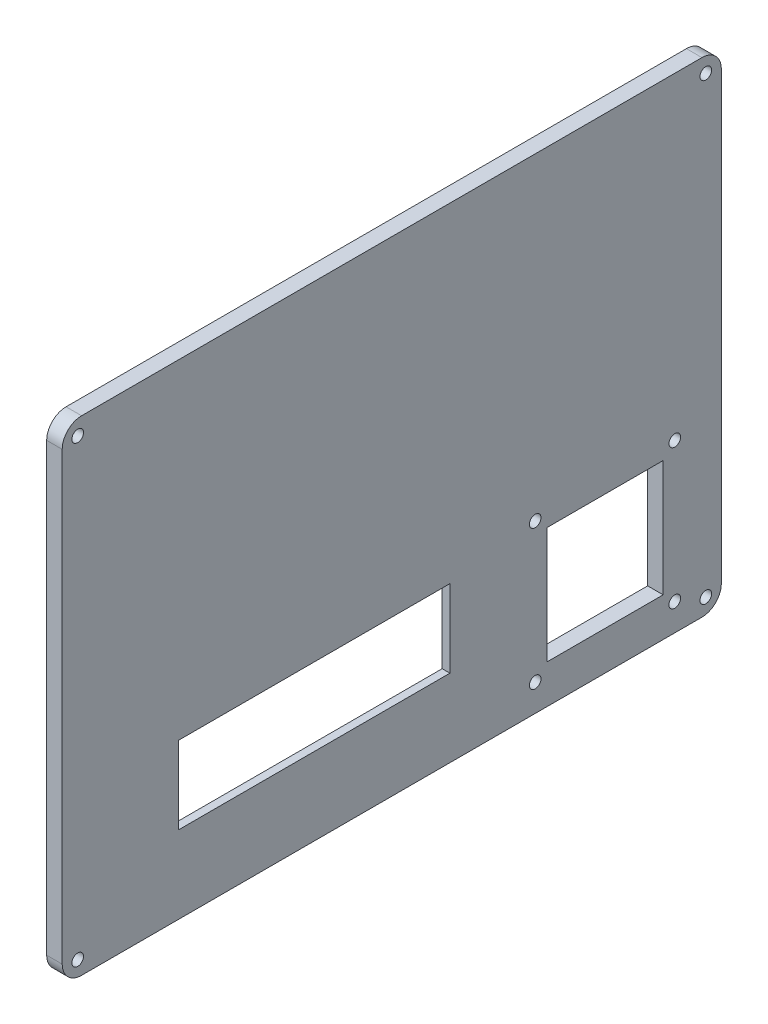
ISO-10303-21;
HEADER;
FILE_DESCRIPTION(('STEP AP214'),'2;1');
FILE_NAME('part.step','',(''),(''),'','','');
FILE_SCHEMA(('AUTOMOTIVE_DESIGN { 1 0 10303 214 1 1 1 1 }'));
ENDSEC;
DATA;
#1=APPLICATION_CONTEXT('core data for automotive mechanical design processes');
#2=APPLICATION_PROTOCOL_DEFINITION('international standard','automotive_design',2000,#1);
#3=PRODUCT_CONTEXT('',#1,'mechanical');
#4=PRODUCT('Part','Part','',(#3));
#5=PRODUCT_RELATED_PRODUCT_CATEGORY('part','',(#4));
#6=PRODUCT_DEFINITION_FORMATION('','',#4);
#7=PRODUCT_DEFINITION_CONTEXT('part definition',#1,'design');
#8=PRODUCT_DEFINITION('design','',#6,#7);
#9=PRODUCT_DEFINITION_SHAPE('','',#8);
#10=(LENGTH_UNIT() NAMED_UNIT(*) SI_UNIT(.MILLI.,.METRE.));
#11=(NAMED_UNIT(*) PLANE_ANGLE_UNIT() SI_UNIT($,.RADIAN.));
#12=(NAMED_UNIT(*) SI_UNIT($,.STERADIAN.) SOLID_ANGLE_UNIT());
#13=UNCERTAINTY_MEASURE_WITH_UNIT(LENGTH_MEASURE(1.E-05),#10,'distance_accuracy_value','');
#14=(GEOMETRIC_REPRESENTATION_CONTEXT(3) GLOBAL_UNCERTAINTY_ASSIGNED_CONTEXT((#13)) GLOBAL_UNIT_ASSIGNED_CONTEXT((#10,
#11,#12)) REPRESENTATION_CONTEXT('',''));
#15=CARTESIAN_POINT('',(0.,0.,0.));
#16=DIRECTION('',(0.,0.,1.));
#17=DIRECTION('',(1.,0.,0.));
#18=AXIS2_PLACEMENT_3D('',#15,#16,#17);
#19=CARTESIAN_POINT('',(4.,-42.5,-15.));
#20=DIRECTION('',(0.,0.,1.));
#21=DIRECTION('',(1.,0.,0.));
#22=AXIS2_PLACEMENT_3D('',#19,#20,#21);
#23=PLANE('',#22);
#24=DIRECTION('',(-1.,0.,0.));
#25=VECTOR('',#24,1.);
#26=CARTESIAN_POINT('',(4.,-22.5,-15.));
#27=LINE('',#26,#25);
#28=CARTESIAN_POINT('',(4.,-22.5,-15.));
#29=VERTEX_POINT('',#28);
#30=CARTESIAN_POINT('',(2.,-22.5,-15.));
#31=VERTEX_POINT('',#30);
#32=EDGE_CURVE('E305',#29,#31,#27,.T.);
#33=ORIENTED_EDGE('',*,*,#32,.T.);
#34=DIRECTION('',(0.,-1.,0.));
#35=VECTOR('',#34,1.);
#36=CARTESIAN_POINT('',(2.,-42.5,-15.));
#37=LINE('',#36,#35);
#38=CARTESIAN_POINT('',(2.,-42.5,-15.));
#39=VERTEX_POINT('',#38);
#40=EDGE_CURVE('E240',#31,#39,#37,.T.);
#41=ORIENTED_EDGE('',*,*,#40,.T.);
#42=DIRECTION('',(-1.,0.,0.));
#43=VECTOR('',#42,1.);
#44=CARTESIAN_POINT('',(4.,-42.5,-15.));
#45=LINE('',#44,#43);
#46=CARTESIAN_POINT('',(4.,-42.5,-15.));
#47=VERTEX_POINT('',#46);
#48=EDGE_CURVE('E293',#47,#39,#45,.T.);
#49=ORIENTED_EDGE('',*,*,#48,.F.);
#50=DIRECTION('',(0.,1.,0.));
#51=VECTOR('',#50,1.);
#52=CARTESIAN_POINT('',(4.,-42.5,-15.));
#53=LINE('',#52,#51);
#54=EDGE_CURVE('E279',#47,#29,#53,.T.);
#55=ORIENTED_EDGE('',*,*,#54,.T.);
#56=EDGE_LOOP('',(#33,#41,#49,#55));
#57=FACE_BOUND('',#56,.T.);
#58=ADVANCED_FACE('F47',(#57),#23,.T.);
#59=CARTESIAN_POINT('',(4.,-22.5,-15.));
#60=DIRECTION('',(0.,-1.,0.));
#61=DIRECTION('',(0.,0.,-1.));
#62=AXIS2_PLACEMENT_3D('',#59,#60,#61);
#63=PLANE('',#62);
#64=DIRECTION('',(-1.,0.,0.));
#65=VECTOR('',#64,1.);
#66=CARTESIAN_POINT('',(4.,-22.5,55.));
#67=LINE('',#66,#65);
#68=CARTESIAN_POINT('',(4.,-22.5,55.));
#69=VERTEX_POINT('',#68);
#70=CARTESIAN_POINT('',(2.,-22.5,55.));
#71=VERTEX_POINT('',#70);
#72=EDGE_CURVE('E301',#69,#71,#67,.T.);
#73=ORIENTED_EDGE('',*,*,#72,.T.);
#74=DIRECTION('',(0.,0.,-1.));
#75=VECTOR('',#74,1.);
#76=CARTESIAN_POINT('',(2.,-22.5,-15.));
#77=LINE('',#76,#75);
#78=EDGE_CURVE('E236',#71,#31,#77,.T.);
#79=ORIENTED_EDGE('',*,*,#78,.T.);
#80=ORIENTED_EDGE('',*,*,#32,.F.);
#81=DIRECTION('',(0.,0.,1.));
#82=VECTOR('',#81,1.);
#83=CARTESIAN_POINT('',(4.,-22.5,-15.));
#84=LINE('',#83,#82);
#85=EDGE_CURVE('E282',#29,#69,#84,.T.);
#86=ORIENTED_EDGE('',*,*,#85,.T.);
#87=EDGE_LOOP('',(#73,#79,#80,#86));
#88=FACE_BOUND('',#87,.T.);
#89=ADVANCED_FACE('F510',(#88),#63,.T.);
#90=CARTESIAN_POINT('',(4.,-42.5,55.));
#91=DIRECTION('',(0.,0.,-1.));
#92=DIRECTION('',(-1.,0.,0.));
#93=AXIS2_PLACEMENT_3D('',#90,#91,#92);
#94=PLANE('',#93);
#95=DIRECTION('',(-1.,0.,0.));
#96=VECTOR('',#95,1.);
#97=CARTESIAN_POINT('',(4.,-42.5,55.));
#98=LINE('',#97,#96);
#99=CARTESIAN_POINT('',(4.,-42.5,55.));
#100=VERTEX_POINT('',#99);
#101=CARTESIAN_POINT('',(2.,-42.5,55.));
#102=VERTEX_POINT('',#101);
#103=EDGE_CURVE('E297',#100,#102,#98,.T.);
#104=ORIENTED_EDGE('',*,*,#103,.T.);
#105=DIRECTION('',(0.,1.,0.));
#106=VECTOR('',#105,1.);
#107=CARTESIAN_POINT('',(2.,-42.5,55.));
#108=LINE('',#107,#106);
#109=EDGE_CURVE('E71',#102,#71,#108,.T.);
#110=ORIENTED_EDGE('',*,*,#109,.T.);
#111=ORIENTED_EDGE('',*,*,#72,.F.);
#112=DIRECTION('',(0.,-1.,0.));
#113=VECTOR('',#112,1.);
#114=CARTESIAN_POINT('',(4.,-42.5,55.));
#115=LINE('',#114,#113);
#116=EDGE_CURVE('E286',#69,#100,#115,.T.);
#117=ORIENTED_EDGE('',*,*,#116,.T.);
#118=EDGE_LOOP('',(#104,#110,#111,#117));
#119=FACE_BOUND('',#118,.T.);
#120=ADVANCED_FACE('F516',(#119),#94,.T.);
#121=CARTESIAN_POINT('',(4.,-42.5,-15.));
#122=DIRECTION('',(0.,1.,0.));
#123=DIRECTION('',(0.,0.,1.));
#124=AXIS2_PLACEMENT_3D('',#121,#122,#123);
#125=PLANE('',#124);
#126=ORIENTED_EDGE('',*,*,#48,.T.);
#127=DIRECTION('',(0.,0.,1.));
#128=VECTOR('',#127,1.);
#129=CARTESIAN_POINT('',(2.,-42.5,-15.));
#130=LINE('',#129,#128);
#131=EDGE_CURVE('E11',#39,#102,#130,.T.);
#132=ORIENTED_EDGE('',*,*,#131,.T.);
#133=ORIENTED_EDGE('',*,*,#103,.F.);
#134=DIRECTION('',(0.,0.,-1.));
#135=VECTOR('',#134,1.);
#136=CARTESIAN_POINT('',(4.,-42.5,-15.));
#137=LINE('',#136,#135);
#138=EDGE_CURVE('E290',#100,#47,#137,.T.);
#139=ORIENTED_EDGE('',*,*,#138,.T.);
#140=EDGE_LOOP('',(#126,#132,#133,#139));
#141=FACE_BOUND('',#140,.T.);
#142=ADVANCED_FACE('F540',(#141),#125,.T.);
#143=CARTESIAN_POINT('',(4.,0.,0.));
#144=DIRECTION('',(1.,0.,0.));
#145=DIRECTION('',(0.,0.,-1.));
#146=AXIS2_PLACEMENT_3D('',#143,#144,#145);
#147=PLANE('',#146);
#148=CARTESIAN_POINT('',(4.,-58.5,81.));
#149=DIRECTION('',(1.,0.,0.));
#150=DIRECTION('',(0.,0.,-1.));
#151=AXIS2_PLACEMENT_3D('',#148,#149,#150);
#152=CIRCLE('',#151,1.50000000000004);
#153=CARTESIAN_POINT('',(4.,-58.5,79.5));
#154=VERTEX_POINT('',#153);
#155=EDGE_CURVE('E250',#154,#154,#152,.F.);
#156=ORIENTED_EDGE('',*,*,#155,.T.);
#157=EDGE_LOOP('',(#156));
#158=FACE_BOUND('',#157,.T.);
#159=CARTESIAN_POINT('',(4.,58.5,-81.));
#160=DIRECTION('',(1.,0.,0.));
#161=DIRECTION('',(0.,0.,-1.));
#162=AXIS2_PLACEMENT_3D('',#159,#160,#161);
#163=CIRCLE('',#162,1.5);
#164=CARTESIAN_POINT('',(4.,58.5,-82.5));
#165=VERTEX_POINT('',#164);
#166=EDGE_CURVE('E249',#165,#165,#163,.F.);
#167=ORIENTED_EDGE('',*,*,#166,.T.);
#168=EDGE_LOOP('',(#167));
#169=FACE_BOUND('',#168,.T.);
#170=CARTESIAN_POINT('',(4.,-55.5,-73.));
#171=DIRECTION('',(1.,0.,0.));
#172=DIRECTION('',(0.,0.,-1.));
#173=AXIS2_PLACEMENT_3D('',#170,#171,#172);
#174=CIRCLE('',#173,1.5);
#175=CARTESIAN_POINT('',(4.,-55.5,-74.5));
#176=VERTEX_POINT('',#175);
#177=EDGE_CURVE('E270',#176,#176,#174,.T.);
#178=ORIENTED_EDGE('',*,*,#177,.F.);
#179=EDGE_LOOP('',(#178));
#180=FACE_BOUND('',#179,.T.);
#181=CARTESIAN_POINT('',(4.,-55.5,-37.));
#182=DIRECTION('',(1.,0.,0.));
#183=DIRECTION('',(0.,0.,-1.));
#184=AXIS2_PLACEMENT_3D('',#181,#182,#183);
#185=CIRCLE('',#184,1.5);
#186=CARTESIAN_POINT('',(4.,-55.5,-38.5));
#187=VERTEX_POINT('',#186);
#188=EDGE_CURVE('E266',#187,#187,#185,.T.);
#189=ORIENTED_EDGE('',*,*,#188,.F.);
#190=EDGE_LOOP('',(#189));
#191=FACE_BOUND('',#190,.T.);
#192=CARTESIAN_POINT('',(4.,-19.5,-37.));
#193=DIRECTION('',(1.,0.,0.));
#194=DIRECTION('',(0.,0.,-1.));
#195=AXIS2_PLACEMENT_3D('',#192,#193,#194);
#196=CIRCLE('',#195,1.5);
#197=CARTESIAN_POINT('',(4.,-19.5,-38.5));
#198=VERTEX_POINT('',#197);
#199=EDGE_CURVE('E261',#198,#198,#196,.T.);
#200=ORIENTED_EDGE('',*,*,#199,.F.);
#201=EDGE_LOOP('',(#200));
#202=FACE_BOUND('',#201,.T.);
#203=CARTESIAN_POINT('',(4.,-19.5,-73.));
#204=DIRECTION('',(1.,0.,0.));
#205=DIRECTION('',(0.,0.,-1.));
#206=AXIS2_PLACEMENT_3D('',#203,#204,#205);
#207=CIRCLE('',#206,1.5);
#208=CARTESIAN_POINT('',(4.,-19.5,-74.5));
#209=VERTEX_POINT('',#208);
#210=EDGE_CURVE('E265',#209,#209,#207,.T.);
#211=ORIENTED_EDGE('',*,*,#210,.F.);
#212=EDGE_LOOP('',(#211));
#213=FACE_BOUND('',#212,.T.);
#214=DIRECTION('',(0.,0.,-1.));
#215=VECTOR('',#214,1.);
#216=CARTESIAN_POINT('',(4.,-62.5,85.));
#217=LINE('',#216,#215);
#218=CARTESIAN_POINT('',(4.,-62.5,80.));
#219=VERTEX_POINT('',#218);
#220=CARTESIAN_POINT('',(4.,-62.5,-80.));
#221=VERTEX_POINT('',#220);
#222=EDGE_CURVE('E366',#219,#221,#217,.T.);
#223=ORIENTED_EDGE('',*,*,#222,.T.);
#224=CARTESIAN_POINT('',(4.,-57.5,-80.));
#225=DIRECTION('',(1.,0.,0.));
#226=DIRECTION('',(0.,0.,-1.));
#227=AXIS2_PLACEMENT_3D('',#224,#225,#226);
#228=CIRCLE('',#227,5.);
#229=CARTESIAN_POINT('',(4.,-57.5,-85.));
#230=VERTEX_POINT('',#229);
#231=EDGE_CURVE('E447',#221,#230,#228,.T.);
#232=ORIENTED_EDGE('',*,*,#231,.T.);
#233=DIRECTION('',(0.,1.,0.));
#234=VECTOR('',#233,1.);
#235=CARTESIAN_POINT('',(4.,62.5,-85.));
#236=LINE('',#235,#234);
#237=CARTESIAN_POINT('',(4.,57.5,-85.));
#238=VERTEX_POINT('',#237);
#239=EDGE_CURVE('E353',#230,#238,#236,.T.);
#240=ORIENTED_EDGE('',*,*,#239,.T.);
#241=CARTESIAN_POINT('',(4.,57.5,-80.));
#242=DIRECTION('',(1.,0.,0.));
#243=DIRECTION('',(0.,0.,-1.));
#244=AXIS2_PLACEMENT_3D('',#241,#242,#243);
#245=CIRCLE('',#244,5.);
#246=CARTESIAN_POINT('',(4.,62.5,-80.));
#247=VERTEX_POINT('',#246);
#248=EDGE_CURVE('E438',#238,#247,#245,.T.);
#249=ORIENTED_EDGE('',*,*,#248,.T.);
#250=DIRECTION('',(0.,0.,1.));
#251=VECTOR('',#250,1.);
#252=CARTESIAN_POINT('',(4.,62.5,85.));
#253=LINE('',#252,#251);
#254=CARTESIAN_POINT('',(4.,62.5,80.));
#255=VERTEX_POINT('',#254);
#256=EDGE_CURVE('E357',#247,#255,#253,.T.);
#257=ORIENTED_EDGE('',*,*,#256,.T.);
#258=CARTESIAN_POINT('',(4.,57.5,80.));
#259=DIRECTION('',(1.,0.,0.));
#260=DIRECTION('',(0.,0.,-1.));
#261=AXIS2_PLACEMENT_3D('',#258,#259,#260);
#262=CIRCLE('',#261,5.);
#263=CARTESIAN_POINT('',(4.,57.5,85.));
#264=VERTEX_POINT('',#263);
#265=EDGE_CURVE('E441',#255,#264,#262,.T.);
#266=ORIENTED_EDGE('',*,*,#265,.T.);
#267=DIRECTION('',(0.,-1.,0.));
#268=VECTOR('',#267,1.);
#269=CARTESIAN_POINT('',(4.,62.5,85.));
#270=LINE('',#269,#268);
#271=CARTESIAN_POINT('',(4.,-57.5,85.));
#272=VERTEX_POINT('',#271);
#273=EDGE_CURVE('E362',#264,#272,#270,.T.);
#274=ORIENTED_EDGE('',*,*,#273,.T.);
#275=CARTESIAN_POINT('',(4.,-57.5,80.));
#276=DIRECTION('',(1.,0.,0.));
#277=DIRECTION('',(0.,0.,-1.));
#278=AXIS2_PLACEMENT_3D('',#275,#276,#277);
#279=CIRCLE('',#278,5.);
#280=EDGE_CURVE('E444',#272,#219,#279,.T.);
#281=ORIENTED_EDGE('',*,*,#280,.T.);
#282=EDGE_LOOP('',(#223,#232,#240,#249,#257,#266,#274,#281));
#283=FACE_BOUND('',#282,.T.);
#284=DIRECTION('',(0.,0.,-1.));
#285=VECTOR('',#284,1.);
#286=CARTESIAN_POINT('',(4.,-52.5,-70.));
#287=LINE('',#286,#285);
#288=CARTESIAN_POINT('',(4.,-52.5,-40.));
#289=VERTEX_POINT('',#288);
#290=CARTESIAN_POINT('',(4.,-52.5,-70.));
#291=VERTEX_POINT('',#290);
#292=EDGE_CURVE('E313',#289,#291,#287,.T.);
#293=ORIENTED_EDGE('',*,*,#292,.F.);
#294=DIRECTION('',(0.,-1.,0.));
#295=VECTOR('',#294,1.);
#296=CARTESIAN_POINT('',(4.,-52.5,-40.));
#297=LINE('',#296,#295);
#298=CARTESIAN_POINT('',(4.,-22.5,-40.));
#299=VERTEX_POINT('',#298);
#300=EDGE_CURVE('E310',#299,#289,#297,.T.);
#301=ORIENTED_EDGE('',*,*,#300,.F.);
#302=DIRECTION('',(0.,0.,1.));
#303=VECTOR('',#302,1.);
#304=CARTESIAN_POINT('',(4.,-22.5,-70.));
#305=LINE('',#304,#303);
#306=CARTESIAN_POINT('',(4.,-22.5,-70.));
#307=VERTEX_POINT('',#306);
#308=EDGE_CURVE('E321',#307,#299,#305,.T.);
#309=ORIENTED_EDGE('',*,*,#308,.F.);
#310=DIRECTION('',(0.,1.,0.));
#311=VECTOR('',#310,1.);
#312=CARTESIAN_POINT('',(4.,-52.5,-70.));
#313=LINE('',#312,#311);
#314=EDGE_CURVE('E317',#291,#307,#313,.T.);
#315=ORIENTED_EDGE('',*,*,#314,.F.);
#316=EDGE_LOOP('',(#293,#301,#309,#315));
#317=FACE_BOUND('',#316,.T.);
#318=ORIENTED_EDGE('',*,*,#85,.F.);
#319=ORIENTED_EDGE('',*,*,#54,.F.);
#320=ORIENTED_EDGE('',*,*,#138,.F.);
#321=ORIENTED_EDGE('',*,*,#116,.F.);
#322=EDGE_LOOP('',(#318,#319,#320,#321));
#323=FACE_BOUND('',#322,.T.);
#324=CARTESIAN_POINT('',(4.,-58.5,-81.));
#325=DIRECTION('',(1.,0.,0.));
#326=DIRECTION('',(0.,0.,-1.));
#327=AXIS2_PLACEMENT_3D('',#324,#325,#326);
#328=CIRCLE('',#327,1.50000000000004);
#329=CARTESIAN_POINT('',(4.,-58.5,-82.5));
#330=VERTEX_POINT('',#329);
#331=EDGE_CURVE('E245',#330,#330,#328,.T.);
#332=ORIENTED_EDGE('',*,*,#331,.F.);
#333=EDGE_LOOP('',(#332));
#334=FACE_BOUND('',#333,.T.);
#335=CARTESIAN_POINT('',(4.,58.5,81.));
#336=DIRECTION('',(1.,0.,0.));
#337=DIRECTION('',(0.,0.,-1.));
#338=AXIS2_PLACEMENT_3D('',#335,#336,#337);
#339=CIRCLE('',#338,1.5);
#340=CARTESIAN_POINT('',(4.,58.5,79.5));
#341=VERTEX_POINT('',#340);
#342=EDGE_CURVE('E244',#341,#341,#339,.T.);
#343=ORIENTED_EDGE('',*,*,#342,.F.);
#344=EDGE_LOOP('',(#343));
#345=FACE_BOUND('',#344,.T.);
#346=ADVANCED_FACE('F470',(#158,#169,#180,#191,#202,#213,#283,#317,#323,#334,#345),#147,.T.);
#347=CARTESIAN_POINT('',(0.,0.,0.));
#348=DIRECTION('',(1.,0.,0.));
#349=DIRECTION('',(0.,0.,-1.));
#350=AXIS2_PLACEMENT_3D('',#347,#348,#349);
#351=PLANE('',#350);
#352=DIRECTION('',(0.,1.,0.));
#353=VECTOR('',#352,1.);
#354=CARTESIAN_POINT('',(0.,-45.5,58.));
#355=LINE('',#354,#353);
#356=CARTESIAN_POINT('',(0.,-45.5,58.));
#357=VERTEX_POINT('',#356);
#358=CARTESIAN_POINT('',(0.,-19.5,58.));
#359=VERTEX_POINT('',#358);
#360=EDGE_CURVE('E220',#357,#359,#355,.T.);
#361=ORIENTED_EDGE('',*,*,#360,.F.);
#362=DIRECTION('',(0.,0.,1.));
#363=VECTOR('',#362,1.);
#364=CARTESIAN_POINT('',(0.,-45.5,-18.));
#365=LINE('',#364,#363);
#366=CARTESIAN_POINT('',(0.,-45.5,-18.));
#367=VERTEX_POINT('',#366);
#368=EDGE_CURVE('E63',#367,#357,#365,.T.);
#369=ORIENTED_EDGE('',*,*,#368,.F.);
#370=DIRECTION('',(0.,-1.,0.));
#371=VECTOR('',#370,1.);
#372=CARTESIAN_POINT('',(0.,-19.5,-18.));
#373=LINE('',#372,#371);
#374=CARTESIAN_POINT('',(0.,-19.5,-18.));
#375=VERTEX_POINT('',#374);
#376=EDGE_CURVE('E207',#375,#367,#373,.T.);
#377=ORIENTED_EDGE('',*,*,#376,.F.);
#378=DIRECTION('',(0.,0.,-1.));
#379=VECTOR('',#378,1.);
#380=CARTESIAN_POINT('',(0.,-19.5,58.));
#381=LINE('',#380,#379);
#382=EDGE_CURVE('E211',#359,#375,#381,.T.);
#383=ORIENTED_EDGE('',*,*,#382,.F.);
#384=EDGE_LOOP('',(#361,#369,#377,#383));
#385=FACE_BOUND('',#384,.T.);
#386=CARTESIAN_POINT('',(0.,-58.5,-81.));
#387=DIRECTION('',(1.,0.,0.));
#388=DIRECTION('',(0.,0.,-1.));
#389=AXIS2_PLACEMENT_3D('',#386,#387,#388);
#390=CIRCLE('',#389,1.50000000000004);
#391=CARTESIAN_POINT('',(0.,-58.5,-82.5));
#392=VERTEX_POINT('',#391);
#393=EDGE_CURVE('E402',#392,#392,#390,.T.);
#394=ORIENTED_EDGE('',*,*,#393,.T.);
#395=EDGE_LOOP('',(#394));
#396=FACE_BOUND('',#395,.T.);
#397=CARTESIAN_POINT('',(0.,58.5,-81.));
#398=DIRECTION('',(1.,0.,0.));
#399=DIRECTION('',(0.,0.,-1.));
#400=AXIS2_PLACEMENT_3D('',#397,#398,#399);
#401=CIRCLE('',#400,1.5);
#402=CARTESIAN_POINT('',(0.,58.5,-82.5));
#403=VERTEX_POINT('',#402);
#404=EDGE_CURVE('E260',#403,#403,#401,.F.);
#405=ORIENTED_EDGE('',*,*,#404,.F.);
#406=EDGE_LOOP('',(#405));
#407=FACE_BOUND('',#406,.T.);
#408=CARTESIAN_POINT('',(0.,-55.5,-73.));
#409=DIRECTION('',(1.,0.,0.));
#410=DIRECTION('',(0.,0.,-1.));
#411=AXIS2_PLACEMENT_3D('',#408,#409,#410);
#412=CIRCLE('',#411,1.5);
#413=CARTESIAN_POINT('',(0.,-55.5,-74.5));
#414=VERTEX_POINT('',#413);
#415=EDGE_CURVE('E283',#414,#414,#412,.T.);
#416=ORIENTED_EDGE('',*,*,#415,.T.);
#417=EDGE_LOOP('',(#416));
#418=FACE_BOUND('',#417,.T.);
#419=CARTESIAN_POINT('',(0.,-55.5,-37.));
#420=DIRECTION('',(1.,0.,0.));
#421=DIRECTION('',(0.,0.,-1.));
#422=AXIS2_PLACEMENT_3D('',#419,#420,#421);
#423=CIRCLE('',#422,1.5);
#424=CARTESIAN_POINT('',(0.,-55.5,-38.5));
#425=VERTEX_POINT('',#424);
#426=EDGE_CURVE('E392',#425,#425,#423,.T.);
#427=ORIENTED_EDGE('',*,*,#426,.T.);
#428=EDGE_LOOP('',(#427));
#429=FACE_BOUND('',#428,.T.);
#430=CARTESIAN_POINT('',(0.,-19.5,-37.));
#431=DIRECTION('',(1.,0.,0.));
#432=DIRECTION('',(0.,0.,-1.));
#433=AXIS2_PLACEMENT_3D('',#430,#431,#432);
#434=CIRCLE('',#433,1.5);
#435=CARTESIAN_POINT('',(0.,-19.5,-38.5));
#436=VERTEX_POINT('',#435);
#437=EDGE_CURVE('E388',#436,#436,#434,.T.);
#438=ORIENTED_EDGE('',*,*,#437,.T.);
#439=EDGE_LOOP('',(#438));
#440=FACE_BOUND('',#439,.T.);
#441=CARTESIAN_POINT('',(0.,-19.5,-73.));
#442=DIRECTION('',(1.,0.,0.));
#443=DIRECTION('',(0.,0.,-1.));
#444=AXIS2_PLACEMENT_3D('',#441,#442,#443);
#445=CIRCLE('',#444,1.5);
#446=CARTESIAN_POINT('',(0.,-19.5,-74.5));
#447=VERTEX_POINT('',#446);
#448=EDGE_CURVE('E278',#447,#447,#445,.T.);
#449=ORIENTED_EDGE('',*,*,#448,.T.);
#450=EDGE_LOOP('',(#449));
#451=FACE_BOUND('',#450,.T.);
#452=DIRECTION('',(0.,-1.,0.));
#453=VECTOR('',#452,1.);
#454=CARTESIAN_POINT('',(0.,-52.5,-40.));
#455=LINE('',#454,#453);
#456=CARTESIAN_POINT('',(0.,-22.5,-40.));
#457=VERTEX_POINT('',#456);
#458=CARTESIAN_POINT('',(0.,-52.5,-40.));
#459=VERTEX_POINT('',#458);
#460=EDGE_CURVE('E309',#457,#459,#455,.T.);
#461=ORIENTED_EDGE('',*,*,#460,.T.);
#462=DIRECTION('',(0.,0.,-1.));
#463=VECTOR('',#462,1.);
#464=CARTESIAN_POINT('',(0.,-52.5,-70.));
#465=LINE('',#464,#463);
#466=CARTESIAN_POINT('',(0.,-52.5,-70.));
#467=VERTEX_POINT('',#466);
#468=EDGE_CURVE('E328',#459,#467,#465,.T.);
#469=ORIENTED_EDGE('',*,*,#468,.T.);
#470=DIRECTION('',(0.,1.,0.));
#471=VECTOR('',#470,1.);
#472=CARTESIAN_POINT('',(0.,-52.5,-70.));
#473=LINE('',#472,#471);
#474=CARTESIAN_POINT('',(0.,-22.5,-70.));
#475=VERTEX_POINT('',#474);
#476=EDGE_CURVE('E332',#467,#475,#473,.T.);
#477=ORIENTED_EDGE('',*,*,#476,.T.);
#478=DIRECTION('',(0.,0.,1.));
#479=VECTOR('',#478,1.);
#480=CARTESIAN_POINT('',(0.,-22.5,-70.));
#481=LINE('',#480,#479);
#482=EDGE_CURVE('E314',#475,#457,#481,.T.);
#483=ORIENTED_EDGE('',*,*,#482,.T.);
#484=EDGE_LOOP('',(#461,#469,#477,#483));
#485=FACE_BOUND('',#484,.T.);
#486=DIRECTION('',(0.,1.,0.));
#487=VECTOR('',#486,1.);
#488=CARTESIAN_POINT('',(0.,62.5,-85.));
#489=LINE('',#488,#487);
#490=CARTESIAN_POINT('',(0.,-57.5,-85.));
#491=VERTEX_POINT('',#490);
#492=CARTESIAN_POINT('',(0.,57.5,-85.));
#493=VERTEX_POINT('',#492);
#494=EDGE_CURVE('E352',#491,#493,#489,.T.);
#495=ORIENTED_EDGE('',*,*,#494,.F.);
#496=CARTESIAN_POINT('',(0.,-57.5,-80.));
#497=DIRECTION('',(1.,0.,0.));
#498=DIRECTION('',(0.,0.,-1.));
#499=AXIS2_PLACEMENT_3D('',#496,#497,#498);
#500=CIRCLE('',#499,5.);
#501=CARTESIAN_POINT('',(0.,-62.5,-80.));
#502=VERTEX_POINT('',#501);
#503=EDGE_CURVE('E428',#491,#502,#500,.F.);
#504=ORIENTED_EDGE('',*,*,#503,.T.);
#505=DIRECTION('',(0.,0.,-1.));
#506=VECTOR('',#505,1.);
#507=CARTESIAN_POINT('',(0.,-62.5,85.));
#508=LINE('',#507,#506);
#509=CARTESIAN_POINT('',(0.,-62.5,80.));
#510=VERTEX_POINT('',#509);
#511=EDGE_CURVE('E358',#510,#502,#508,.T.);
#512=ORIENTED_EDGE('',*,*,#511,.F.);
#513=CARTESIAN_POINT('',(0.,-57.5,80.));
#514=DIRECTION('',(1.,0.,0.));
#515=DIRECTION('',(0.,0.,-1.));
#516=AXIS2_PLACEMENT_3D('',#513,#514,#515);
#517=CIRCLE('',#516,5.);
#518=CARTESIAN_POINT('',(0.,-57.5,85.));
#519=VERTEX_POINT('',#518);
#520=EDGE_CURVE('E425',#510,#519,#517,.F.);
#521=ORIENTED_EDGE('',*,*,#520,.T.);
#522=DIRECTION('',(0.,-1.,0.));
#523=VECTOR('',#522,1.);
#524=CARTESIAN_POINT('',(0.,62.5,85.));
#525=LINE('',#524,#523);
#526=CARTESIAN_POINT('',(0.,57.5,85.));
#527=VERTEX_POINT('',#526);
#528=EDGE_CURVE('E378',#527,#519,#525,.T.);
#529=ORIENTED_EDGE('',*,*,#528,.F.);
#530=CARTESIAN_POINT('',(0.,57.5,80.));
#531=DIRECTION('',(1.,0.,0.));
#532=DIRECTION('',(0.,0.,-1.));
#533=AXIS2_PLACEMENT_3D('',#530,#531,#532);
#534=CIRCLE('',#533,5.);
#535=CARTESIAN_POINT('',(0.,62.5,80.));
#536=VERTEX_POINT('',#535);
#537=EDGE_CURVE('E422',#527,#536,#534,.F.);
#538=ORIENTED_EDGE('',*,*,#537,.T.);
#539=DIRECTION('',(0.,0.,1.));
#540=VECTOR('',#539,1.);
#541=CARTESIAN_POINT('',(0.,62.5,85.));
#542=LINE('',#541,#540);
#543=CARTESIAN_POINT('',(0.,62.5,-80.));
#544=VERTEX_POINT('',#543);
#545=EDGE_CURVE('E374',#544,#536,#542,.T.);
#546=ORIENTED_EDGE('',*,*,#545,.F.);
#547=CARTESIAN_POINT('',(0.,57.5,-80.));
#548=DIRECTION('',(1.,0.,0.));
#549=DIRECTION('',(0.,0.,-1.));
#550=AXIS2_PLACEMENT_3D('',#547,#548,#549);
#551=CIRCLE('',#550,5.);
#552=EDGE_CURVE('E419',#544,#493,#551,.F.);
#553=ORIENTED_EDGE('',*,*,#552,.T.);
#554=EDGE_LOOP('',(#495,#504,#512,#521,#529,#538,#546,#553));
#555=FACE_BOUND('',#554,.T.);
#556=CARTESIAN_POINT('',(0.,-58.5,81.));
#557=DIRECTION('',(1.,0.,0.));
#558=DIRECTION('',(0.,0.,-1.));
#559=AXIS2_PLACEMENT_3D('',#556,#557,#558);
#560=CIRCLE('',#559,1.50000000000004);
#561=CARTESIAN_POINT('',(0.,-58.5,79.5));
#562=VERTEX_POINT('',#561);
#563=EDGE_CURVE('E406',#562,#562,#560,.F.);
#564=ORIENTED_EDGE('',*,*,#563,.F.);
#565=EDGE_LOOP('',(#564));
#566=FACE_BOUND('',#565,.T.);
#567=CARTESIAN_POINT('',(0.,58.5,81.));
#568=DIRECTION('',(1.,0.,0.));
#569=DIRECTION('',(0.,0.,-1.));
#570=AXIS2_PLACEMENT_3D('',#567,#568,#569);
#571=CIRCLE('',#570,1.5);
#572=CARTESIAN_POINT('',(0.,58.5,79.5));
#573=VERTEX_POINT('',#572);
#574=EDGE_CURVE('E274',#573,#573,#571,.T.);
#575=ORIENTED_EDGE('',*,*,#574,.T.);
#576=EDGE_LOOP('',(#575));
#577=FACE_BOUND('',#576,.T.);
#578=ADVANCED_FACE('F482',(#385,#396,#407,#418,#429,#440,#451,#485,#555,#566,#577),#351,.F.);
#579=CARTESIAN_POINT('',(4.,62.5,-85.));
#580=DIRECTION('',(0.,0.,1.));
#581=DIRECTION('',(1.,0.,0.));
#582=AXIS2_PLACEMENT_3D('',#579,#580,#581);
#583=PLANE('',#582);
#584=ORIENTED_EDGE('',*,*,#239,.F.);
#585=DIRECTION('',(-1.,0.,0.));
#586=VECTOR('',#585,1.);
#587=CARTESIAN_POINT('',(4.,-57.5,-85.));
#588=LINE('',#587,#586);
#589=EDGE_CURVE('E415',#230,#491,#588,.T.);
#590=ORIENTED_EDGE('',*,*,#589,.T.);
#591=ORIENTED_EDGE('',*,*,#494,.T.);
#592=DIRECTION('',(-1.,0.,0.));
#593=VECTOR('',#592,1.);
#594=CARTESIAN_POINT('',(4.,57.5,-85.));
#595=LINE('',#594,#593);
#596=EDGE_CURVE('E370',#493,#238,#595,.F.);
#597=ORIENTED_EDGE('',*,*,#596,.T.);
#598=EDGE_LOOP('',(#584,#590,#591,#597));
#599=FACE_BOUND('',#598,.T.);
#600=ADVANCED_FACE('F499',(#599),#583,.F.);
#601=CARTESIAN_POINT('',(4.,62.5,85.));
#602=DIRECTION('',(0.,-1.,0.));
#603=DIRECTION('',(0.,0.,-1.));
#604=AXIS2_PLACEMENT_3D('',#601,#602,#603);
#605=PLANE('',#604);
#606=ORIENTED_EDGE('',*,*,#545,.T.);
#607=DIRECTION('',(-1.,0.,0.));
#608=VECTOR('',#607,1.);
#609=CARTESIAN_POINT('',(4.,62.5,80.));
#610=LINE('',#609,#608);
#611=EDGE_CURVE('E56',#536,#255,#610,.F.);
#612=ORIENTED_EDGE('',*,*,#611,.T.);
#613=ORIENTED_EDGE('',*,*,#256,.F.);
#614=DIRECTION('',(-1.,0.,0.));
#615=VECTOR('',#614,1.);
#616=CARTESIAN_POINT('',(4.,62.5,-80.));
#617=LINE('',#616,#615);
#618=EDGE_CURVE('E457',#247,#544,#617,.T.);
#619=ORIENTED_EDGE('',*,*,#618,.T.);
#620=EDGE_LOOP('',(#606,#612,#613,#619));
#621=FACE_BOUND('',#620,.T.);
#622=ADVANCED_FACE('F464',(#621),#605,.F.);
#623=CARTESIAN_POINT('',(4.,62.5,85.));
#624=DIRECTION('',(0.,0.,-1.));
#625=DIRECTION('',(-1.,0.,0.));
#626=AXIS2_PLACEMENT_3D('',#623,#624,#625);
#627=PLANE('',#626);
#628=ORIENTED_EDGE('',*,*,#528,.T.);
#629=DIRECTION('',(-1.,0.,0.));
#630=VECTOR('',#629,1.);
#631=CARTESIAN_POINT('',(4.,-57.5,85.));
#632=LINE('',#631,#630);
#633=EDGE_CURVE('E454',#519,#272,#632,.F.);
#634=ORIENTED_EDGE('',*,*,#633,.T.);
#635=ORIENTED_EDGE('',*,*,#273,.F.);
#636=DIRECTION('',(-1.,0.,0.));
#637=VECTOR('',#636,1.);
#638=CARTESIAN_POINT('',(4.,57.5,85.));
#639=LINE('',#638,#637);
#640=EDGE_CURVE('E450',#264,#527,#639,.T.);
#641=ORIENTED_EDGE('',*,*,#640,.T.);
#642=EDGE_LOOP('',(#628,#634,#635,#641));
#643=FACE_BOUND('',#642,.T.);
#644=ADVANCED_FACE('F478',(#643),#627,.F.);
#645=CARTESIAN_POINT('',(4.,-62.5,85.));
#646=DIRECTION('',(0.,1.,0.));
#647=DIRECTION('',(0.,0.,1.));
#648=AXIS2_PLACEMENT_3D('',#645,#646,#647);
#649=PLANE('',#648);
#650=ORIENTED_EDGE('',*,*,#511,.T.);
#651=DIRECTION('',(-1.,0.,0.));
#652=VECTOR('',#651,1.);
#653=CARTESIAN_POINT('',(4.,-62.5,-80.));
#654=LINE('',#653,#652);
#655=EDGE_CURVE('E435',#502,#221,#654,.F.);
#656=ORIENTED_EDGE('',*,*,#655,.T.);
#657=ORIENTED_EDGE('',*,*,#222,.F.);
#658=DIRECTION('',(-1.,0.,0.));
#659=VECTOR('',#658,1.);
#660=CARTESIAN_POINT('',(4.,-62.5,80.));
#661=LINE('',#660,#659);
#662=EDGE_CURVE('E431',#219,#510,#661,.T.);
#663=ORIENTED_EDGE('',*,*,#662,.T.);
#664=EDGE_LOOP('',(#650,#656,#657,#663));
#665=FACE_BOUND('',#664,.T.);
#666=ADVANCED_FACE('F491',(#665),#649,.F.);
#667=CARTESIAN_POINT('',(4.,-52.5,-40.));
#668=DIRECTION('',(0.,0.,-1.));
#669=DIRECTION('',(-1.,0.,0.));
#670=AXIS2_PLACEMENT_3D('',#667,#668,#669);
#671=PLANE('',#670);
#672=ORIENTED_EDGE('',*,*,#460,.F.);
#673=DIRECTION('',(-1.,0.,0.));
#674=VECTOR('',#673,1.);
#675=CARTESIAN_POINT('',(4.,-22.5,-40.));
#676=LINE('',#675,#674);
#677=EDGE_CURVE('E324',#299,#457,#676,.T.);
#678=ORIENTED_EDGE('',*,*,#677,.F.);
#679=ORIENTED_EDGE('',*,*,#300,.T.);
#680=DIRECTION('',(-1.,0.,0.));
#681=VECTOR('',#680,1.);
#682=CARTESIAN_POINT('',(4.,-52.5,-40.));
#683=LINE('',#682,#681);
#684=EDGE_CURVE('E348',#289,#459,#683,.T.);
#685=ORIENTED_EDGE('',*,*,#684,.T.);
#686=EDGE_LOOP('',(#672,#678,#679,#685));
#687=FACE_BOUND('',#686,.T.);
#688=ADVANCED_FACE('F533',(#687),#671,.T.);
#689=CARTESIAN_POINT('',(4.,-52.5,-70.));
#690=DIRECTION('',(0.,1.,0.));
#691=DIRECTION('',(0.,0.,1.));
#692=AXIS2_PLACEMENT_3D('',#689,#690,#691);
#693=PLANE('',#692);
#694=ORIENTED_EDGE('',*,*,#468,.F.);
#695=ORIENTED_EDGE('',*,*,#684,.F.);
#696=ORIENTED_EDGE('',*,*,#292,.T.);
#697=DIRECTION('',(-1.,0.,0.));
#698=VECTOR('',#697,1.);
#699=CARTESIAN_POINT('',(4.,-52.5,-70.));
#700=LINE('',#699,#698);
#701=EDGE_CURVE('E345',#291,#467,#700,.T.);
#702=ORIENTED_EDGE('',*,*,#701,.T.);
#703=EDGE_LOOP('',(#694,#695,#696,#702));
#704=FACE_BOUND('',#703,.T.);
#705=ADVANCED_FACE('F529',(#704),#693,.T.);
#706=CARTESIAN_POINT('',(4.,-52.5,-70.));
#707=DIRECTION('',(0.,0.,1.));
#708=DIRECTION('',(1.,0.,0.));
#709=AXIS2_PLACEMENT_3D('',#706,#707,#708);
#710=PLANE('',#709);
#711=ORIENTED_EDGE('',*,*,#476,.F.);
#712=ORIENTED_EDGE('',*,*,#701,.F.);
#713=ORIENTED_EDGE('',*,*,#314,.T.);
#714=DIRECTION('',(-1.,0.,0.));
#715=VECTOR('',#714,1.);
#716=CARTESIAN_POINT('',(4.,-22.5,-70.));
#717=LINE('',#716,#715);
#718=EDGE_CURVE('E342',#307,#475,#717,.T.);
#719=ORIENTED_EDGE('',*,*,#718,.T.);
#720=EDGE_LOOP('',(#711,#712,#713,#719));
#721=FACE_BOUND('',#720,.T.);
#722=ADVANCED_FACE('F525',(#721),#710,.T.);
#723=CARTESIAN_POINT('',(4.,-22.5,-70.));
#724=DIRECTION('',(0.,-1.,0.));
#725=DIRECTION('',(0.,0.,-1.));
#726=AXIS2_PLACEMENT_3D('',#723,#724,#725);
#727=PLANE('',#726);
#728=ORIENTED_EDGE('',*,*,#482,.F.);
#729=ORIENTED_EDGE('',*,*,#718,.F.);
#730=ORIENTED_EDGE('',*,*,#308,.T.);
#731=ORIENTED_EDGE('',*,*,#677,.T.);
#732=EDGE_LOOP('',(#728,#729,#730,#731));
#733=FACE_BOUND('',#732,.T.);
#734=ADVANCED_FACE('F521',(#733),#727,.T.);
#735=CARTESIAN_POINT('',(-6.,-19.5,-73.));
#736=DIRECTION('',(1.,0.,0.));
#737=DIRECTION('',(0.,0.,-1.));
#738=AXIS2_PLACEMENT_3D('',#735,#736,#737);
#739=CYLINDRICAL_SURFACE('',#738,1.5);
#740=ORIENTED_EDGE('',*,*,#210,.T.);
#741=EDGE_LOOP('',(#740));
#742=FACE_BOUND('',#741,.T.);
#743=ORIENTED_EDGE('',*,*,#448,.F.);
#744=EDGE_LOOP('',(#743));
#745=FACE_BOUND('',#744,.T.);
#746=ADVANCED_FACE('F524',(#742,#745),#739,.F.);
#747=CARTESIAN_POINT('',(-6.,-19.5,-37.));
#748=DIRECTION('',(1.,0.,0.));
#749=DIRECTION('',(0.,0.,-1.));
#750=AXIS2_PLACEMENT_3D('',#747,#748,#749);
#751=CYLINDRICAL_SURFACE('',#750,1.5);
#752=ORIENTED_EDGE('',*,*,#199,.T.);
#753=EDGE_LOOP('',(#752));
#754=FACE_BOUND('',#753,.T.);
#755=ORIENTED_EDGE('',*,*,#437,.F.);
#756=EDGE_LOOP('',(#755));
#757=FACE_BOUND('',#756,.T.);
#758=ADVANCED_FACE('F656',(#754,#757),#751,.F.);
#759=CARTESIAN_POINT('',(-6.,-55.5,-37.));
#760=DIRECTION('',(1.,0.,0.));
#761=DIRECTION('',(0.,0.,-1.));
#762=AXIS2_PLACEMENT_3D('',#759,#760,#761);
#763=CYLINDRICAL_SURFACE('',#762,1.5);
#764=ORIENTED_EDGE('',*,*,#188,.T.);
#765=EDGE_LOOP('',(#764));
#766=FACE_BOUND('',#765,.T.);
#767=ORIENTED_EDGE('',*,*,#426,.F.);
#768=EDGE_LOOP('',(#767));
#769=FACE_BOUND('',#768,.T.);
#770=ADVANCED_FACE('F659',(#766,#769),#763,.F.);
#771=CARTESIAN_POINT('',(-6.,-55.5,-73.));
#772=DIRECTION('',(1.,0.,0.));
#773=DIRECTION('',(0.,0.,-1.));
#774=AXIS2_PLACEMENT_3D('',#771,#772,#773);
#775=CYLINDRICAL_SURFACE('',#774,1.5);
#776=ORIENTED_EDGE('',*,*,#177,.T.);
#777=EDGE_LOOP('',(#776));
#778=FACE_BOUND('',#777,.T.);
#779=ORIENTED_EDGE('',*,*,#415,.F.);
#780=EDGE_LOOP('',(#779));
#781=FACE_BOUND('',#780,.T.);
#782=ADVANCED_FACE('F654',(#778,#781),#775,.F.);
#783=CARTESIAN_POINT('',(-6.,58.5,-81.));
#784=DIRECTION('',(1.,0.,0.));
#785=DIRECTION('',(0.,0.,-1.));
#786=AXIS2_PLACEMENT_3D('',#783,#784,#785);
#787=CYLINDRICAL_SURFACE('',#786,1.5);
#788=ORIENTED_EDGE('',*,*,#166,.F.);
#789=EDGE_LOOP('',(#788));
#790=FACE_BOUND('',#789,.T.);
#791=ORIENTED_EDGE('',*,*,#404,.T.);
#792=EDGE_LOOP('',(#791));
#793=FACE_BOUND('',#792,.T.);
#794=ADVANCED_FACE('F644',(#790,#793),#787,.F.);
#795=CARTESIAN_POINT('',(-6.,-58.5,-81.));
#796=DIRECTION('',(1.,0.,0.));
#797=DIRECTION('',(0.,0.,-1.));
#798=AXIS2_PLACEMENT_3D('',#795,#796,#797);
#799=CYLINDRICAL_SURFACE('',#798,1.50000000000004);
#800=ORIENTED_EDGE('',*,*,#331,.T.);
#801=EDGE_LOOP('',(#800));
#802=FACE_BOUND('',#801,.T.);
#803=ORIENTED_EDGE('',*,*,#393,.F.);
#804=EDGE_LOOP('',(#803));
#805=FACE_BOUND('',#804,.T.);
#806=ADVANCED_FACE('F640',(#802,#805),#799,.F.);
#807=CARTESIAN_POINT('',(-6.,-58.5,81.));
#808=DIRECTION('',(1.,0.,0.));
#809=DIRECTION('',(0.,0.,-1.));
#810=AXIS2_PLACEMENT_3D('',#807,#808,#809);
#811=CYLINDRICAL_SURFACE('',#810,1.50000000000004);
#812=ORIENTED_EDGE('',*,*,#155,.F.);
#813=EDGE_LOOP('',(#812));
#814=FACE_BOUND('',#813,.T.);
#815=ORIENTED_EDGE('',*,*,#563,.T.);
#816=EDGE_LOOP('',(#815));
#817=FACE_BOUND('',#816,.T.);
#818=ADVANCED_FACE('F643',(#814,#817),#811,.F.);
#819=CARTESIAN_POINT('',(-6.,58.5,81.));
#820=DIRECTION('',(1.,0.,0.));
#821=DIRECTION('',(0.,0.,-1.));
#822=AXIS2_PLACEMENT_3D('',#819,#820,#821);
#823=CYLINDRICAL_SURFACE('',#822,1.5);
#824=ORIENTED_EDGE('',*,*,#342,.T.);
#825=EDGE_LOOP('',(#824));
#826=FACE_BOUND('',#825,.T.);
#827=ORIENTED_EDGE('',*,*,#574,.F.);
#828=EDGE_LOOP('',(#827));
#829=FACE_BOUND('',#828,.T.);
#830=ADVANCED_FACE('F555',(#826,#829),#823,.F.);
#831=CARTESIAN_POINT('',(4.,-57.5,-80.));
#832=DIRECTION('',(-1.,0.,0.));
#833=DIRECTION('',(0.,0.,1.));
#834=AXIS2_PLACEMENT_3D('',#831,#832,#833);
#835=CYLINDRICAL_SURFACE('',#834,5.);
#836=ORIENTED_EDGE('',*,*,#231,.F.);
#837=ORIENTED_EDGE('',*,*,#655,.F.);
#838=ORIENTED_EDGE('',*,*,#503,.F.);
#839=ORIENTED_EDGE('',*,*,#589,.F.);
#840=EDGE_LOOP('',(#836,#837,#838,#839));
#841=FACE_BOUND('',#840,.T.);
#842=ADVANCED_FACE('F497',(#841),#835,.T.);
#843=CARTESIAN_POINT('',(4.,-57.5,80.));
#844=DIRECTION('',(-1.,0.,0.));
#845=DIRECTION('',(0.,0.,1.));
#846=AXIS2_PLACEMENT_3D('',#843,#844,#845);
#847=CYLINDRICAL_SURFACE('',#846,5.);
#848=ORIENTED_EDGE('',*,*,#280,.F.);
#849=ORIENTED_EDGE('',*,*,#633,.F.);
#850=ORIENTED_EDGE('',*,*,#520,.F.);
#851=ORIENTED_EDGE('',*,*,#662,.F.);
#852=EDGE_LOOP('',(#848,#849,#850,#851));
#853=FACE_BOUND('',#852,.T.);
#854=ADVANCED_FACE('F488',(#853),#847,.T.);
#855=CARTESIAN_POINT('',(4.,57.5,80.));
#856=DIRECTION('',(-1.,0.,0.));
#857=DIRECTION('',(0.,0.,1.));
#858=AXIS2_PLACEMENT_3D('',#855,#856,#857);
#859=CYLINDRICAL_SURFACE('',#858,5.);
#860=ORIENTED_EDGE('',*,*,#265,.F.);
#861=ORIENTED_EDGE('',*,*,#611,.F.);
#862=ORIENTED_EDGE('',*,*,#537,.F.);
#863=ORIENTED_EDGE('',*,*,#640,.F.);
#864=EDGE_LOOP('',(#860,#861,#862,#863));
#865=FACE_BOUND('',#864,.T.);
#866=ADVANCED_FACE('F475',(#865),#859,.T.);
#867=CARTESIAN_POINT('',(4.,57.5,-80.));
#868=DIRECTION('',(-1.,0.,0.));
#869=DIRECTION('',(0.,0.,1.));
#870=AXIS2_PLACEMENT_3D('',#867,#868,#869);
#871=CYLINDRICAL_SURFACE('',#870,5.);
#872=ORIENTED_EDGE('',*,*,#248,.F.);
#873=ORIENTED_EDGE('',*,*,#596,.F.);
#874=ORIENTED_EDGE('',*,*,#552,.F.);
#875=ORIENTED_EDGE('',*,*,#618,.F.);
#876=EDGE_LOOP('',(#872,#873,#874,#875));
#877=FACE_BOUND('',#876,.T.);
#878=ADVANCED_FACE('F49',(#877),#871,.T.);
#879=CARTESIAN_POINT('',(2.,-45.5,-18.));
#880=DIRECTION('',(0.,-1.,0.));
#881=DIRECTION('',(0.,0.,-1.));
#882=AXIS2_PLACEMENT_3D('',#879,#880,#881);
#883=PLANE('',#882);
#884=ORIENTED_EDGE('',*,*,#368,.T.);
#885=DIRECTION('',(-1.,0.,0.));
#886=VECTOR('',#885,1.);
#887=CARTESIAN_POINT('',(2.,-45.5,58.));
#888=LINE('',#887,#886);
#889=CARTESIAN_POINT('',(2.,-45.5,58.));
#890=VERTEX_POINT('',#889);
#891=EDGE_CURVE('E182',#890,#357,#888,.T.);
#892=ORIENTED_EDGE('',*,*,#891,.F.);
#893=DIRECTION('',(0.,0.,1.));
#894=VECTOR('',#893,1.);
#895=CARTESIAN_POINT('',(2.,-45.5,-18.));
#896=LINE('',#895,#894);
#897=CARTESIAN_POINT('',(2.,-45.5,-18.));
#898=VERTEX_POINT('',#897);
#899=EDGE_CURVE('E186',#898,#890,#896,.T.);
#900=ORIENTED_EDGE('',*,*,#899,.F.);
#901=DIRECTION('',(-1.,0.,0.));
#902=VECTOR('',#901,1.);
#903=CARTESIAN_POINT('',(2.,-45.5,-18.));
#904=LINE('',#903,#902);
#905=EDGE_CURVE('E226',#898,#367,#904,.T.);
#906=ORIENTED_EDGE('',*,*,#905,.T.);
#907=EDGE_LOOP('',(#884,#892,#900,#906));
#908=FACE_BOUND('',#907,.T.);
#909=ADVANCED_FACE('F184',(#908),#883,.F.);
#910=CARTESIAN_POINT('',(2.,-19.5,-18.));
#911=DIRECTION('',(0.,0.,-1.));
#912=DIRECTION('',(-1.,0.,0.));
#913=AXIS2_PLACEMENT_3D('',#910,#911,#912);
#914=PLANE('',#913);
#915=ORIENTED_EDGE('',*,*,#376,.T.);
#916=ORIENTED_EDGE('',*,*,#905,.F.);
#917=DIRECTION('',(0.,-1.,0.));
#918=VECTOR('',#917,1.);
#919=CARTESIAN_POINT('',(2.,-19.5,-18.));
#920=LINE('',#919,#918);
#921=CARTESIAN_POINT('',(2.,-19.5,-18.));
#922=VERTEX_POINT('',#921);
#923=EDGE_CURVE('E193',#922,#898,#920,.T.);
#924=ORIENTED_EDGE('',*,*,#923,.F.);
#925=DIRECTION('',(-1.,0.,0.));
#926=VECTOR('',#925,1.);
#927=CARTESIAN_POINT('',(2.,-19.5,-18.));
#928=LINE('',#927,#926);
#929=EDGE_CURVE('E229',#922,#375,#928,.T.);
#930=ORIENTED_EDGE('',*,*,#929,.T.);
#931=EDGE_LOOP('',(#915,#916,#924,#930));
#932=FACE_BOUND('',#931,.T.);
#933=ADVANCED_FACE('F508',(#932),#914,.F.);
#934=CARTESIAN_POINT('',(2.,-19.5,58.));
#935=DIRECTION('',(0.,1.,0.));
#936=DIRECTION('',(0.,0.,1.));
#937=AXIS2_PLACEMENT_3D('',#934,#935,#936);
#938=PLANE('',#937);
#939=ORIENTED_EDGE('',*,*,#382,.T.);
#940=ORIENTED_EDGE('',*,*,#929,.F.);
#941=DIRECTION('',(0.,0.,-1.));
#942=VECTOR('',#941,1.);
#943=CARTESIAN_POINT('',(2.,-19.5,58.));
#944=LINE('',#943,#942);
#945=CARTESIAN_POINT('',(2.,-19.5,58.));
#946=VERTEX_POINT('',#945);
#947=EDGE_CURVE('E202',#946,#922,#944,.T.);
#948=ORIENTED_EDGE('',*,*,#947,.F.);
#949=DIRECTION('',(-1.,0.,0.));
#950=VECTOR('',#949,1.);
#951=CARTESIAN_POINT('',(2.,-19.5,58.));
#952=LINE('',#951,#950);
#953=EDGE_CURVE('E192',#946,#359,#952,.T.);
#954=ORIENTED_EDGE('',*,*,#953,.T.);
#955=EDGE_LOOP('',(#939,#940,#948,#954));
#956=FACE_BOUND('',#955,.T.);
#957=ADVANCED_FACE('F610',(#956),#938,.F.);
#958=CARTESIAN_POINT('',(2.,-45.5,58.));
#959=DIRECTION('',(0.,0.,1.));
#960=DIRECTION('',(1.,0.,0.));
#961=AXIS2_PLACEMENT_3D('',#958,#959,#960);
#962=PLANE('',#961);
#963=ORIENTED_EDGE('',*,*,#360,.T.);
#964=ORIENTED_EDGE('',*,*,#953,.F.);
#965=DIRECTION('',(0.,1.,0.));
#966=VECTOR('',#965,1.);
#967=CARTESIAN_POINT('',(2.,-45.5,58.));
#968=LINE('',#967,#966);
#969=EDGE_CURVE('E196',#890,#946,#968,.T.);
#970=ORIENTED_EDGE('',*,*,#969,.F.);
#971=ORIENTED_EDGE('',*,*,#891,.T.);
#972=EDGE_LOOP('',(#963,#964,#970,#971));
#973=FACE_BOUND('',#972,.T.);
#974=ADVANCED_FACE('F197',(#973),#962,.F.);
#975=CARTESIAN_POINT('',(2.,0.,0.));
#976=DIRECTION('',(-1.,0.,0.));
#977=DIRECTION('',(0.,0.,1.));
#978=AXIS2_PLACEMENT_3D('',#975,#976,#977);
#979=PLANE('',#978);
#980=ORIENTED_EDGE('',*,*,#78,.F.);
#981=ORIENTED_EDGE('',*,*,#109,.F.);
#982=ORIENTED_EDGE('',*,*,#131,.F.);
#983=ORIENTED_EDGE('',*,*,#40,.F.);
#984=EDGE_LOOP('',(#980,#981,#982,#983));
#985=FACE_BOUND('',#984,.T.);
#986=ORIENTED_EDGE('',*,*,#899,.T.);
#987=ORIENTED_EDGE('',*,*,#969,.T.);
#988=ORIENTED_EDGE('',*,*,#947,.T.);
#989=ORIENTED_EDGE('',*,*,#923,.T.);
#990=EDGE_LOOP('',(#986,#987,#988,#989));
#991=FACE_BOUND('',#990,.T.);
#992=ADVANCED_FACE('F204',(#985,#991),#979,.T.);
#993=CLOSED_SHELL('',(#58,#89,#120,#142,#346,#578,#600,#622,#644,#666,#688,#705,#722,#734,#746,
#758,#770,#782,#794,#806,#818,#830,#842,#854,#866,#878,#909,#933,#957,#974,#992));
#994=MANIFOLD_SOLID_BREP('B2',#993);
#995=ADVANCED_BREP_SHAPE_REPRESENTATION('',(#18,#994),#14);
#996=SHAPE_DEFINITION_REPRESENTATION(#9,#995);
ENDSEC;
END-ISO-10303-21;
